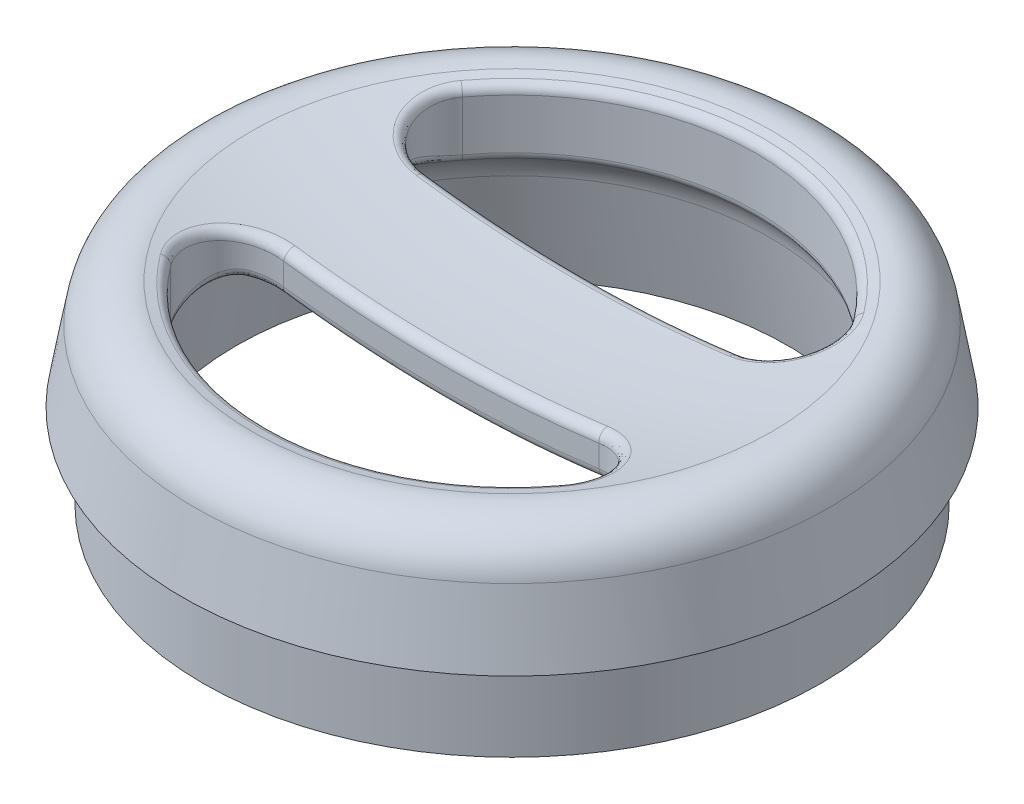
from build123d import *

# Parameters (mm, degrees)
SKETCH1_R        = 16.6751
SHAFT_DEPTH      = 4.572
VENT_HOLES_DEPTH = 26.837631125
FILLET1_R        = 0.508


with BuildPart() as part:
    # Sketch1 → Shaft (new body)
    with BuildSketch(Plane(origin=(0, 0, 0), x_dir=(1, 0, 0), z_dir=(0, 1, 0))):
        with Locations(Location((0, 0, 0), (0, 0, 270))):
            Circle(SKETCH1_R)
    extrude(amount=-SHAFT_DEPTH)

    # Sketch11 → Cap OD (revolve)
    with BuildSketch(Plane.XY, mode=Mode.PRIVATE) as cap_od_sk:
        with BuildLine():
            Line((0, 0), (17.78, 0))
            Line((17.78, 0), (17.102081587, 3.844666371))
            ThreePointArc((17.102081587, 3.844666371), (16.008019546, 5.518066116), (14.042001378, 5.881399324))
            ThreePointArc((14.042001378, 5.881399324), (7.064382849, 4.710053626), (0, 4.318))
            Line((0, 4.318), (0, 0))
        make_face()
    revolve(cap_od_sk.sketch.rotate(Axis((0, 0, 0), (0, 1, 0)), 90), axis=Axis((0, 0, 0), (0, 1, 0)))

    # Sketch12 → Inside (revolve, cut)
    with BuildSketch(Plane.XY):
        with BuildLine():
            Line((14.8844, -4.572), (13.906085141, 0.976299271))
            ThreePointArc((13.906085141, 0.976299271), (12.869307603, 2.610430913), (10.982278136, 3.039865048))
            ThreePointArc((10.982278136, 3.039865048), (5.5103546, 2.35059348), (0, 2.120300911))
            Line((0, 2.120300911), (0, -4.572))
            Line((0, -4.572), (14.8844, -4.572))
        make_face()
    revolve(axis=Axis((0, 11.538585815, 0), (0, -1, 0)), mode=Mode.SUBTRACT)

    # Sketch13 → Vent Holes (cut, through all)
    with BuildSketch(Plane(origin=(0, 0, 0), x_dir=(1, 0, 0), z_dir=(0, 1, 0))):
        with BuildLine():
            Line((-8.508962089, 3.81), (8.508962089, 3.81))
            ThreePointArc((8.508962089, 3.81), (10.779447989, 5.211363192), (10.544598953, 7.869138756))
            ThreePointArc((10.544598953, 7.869138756), (0, 13.1572), (-10.544598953, 7.869138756))
            ThreePointArc((-10.544598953, 7.869138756), (-10.779447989, 5.211363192), (-8.508962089, 3.81))
        make_face()
        with BuildLine():
            Line((-8.508962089, -3.81), (8.508962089, -3.81))
            ThreePointArc((8.508962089, -3.81), (10.779447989, -5.211363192), (10.544598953, -7.869138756))
            ThreePointArc((10.544598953, -7.869138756), (0, -13.1572), (-10.544598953, -7.869138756))
            ThreePointArc((-10.544598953, -7.869138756), (-10.779447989, -5.211363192), (-8.508962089, -3.81))
        make_face()
    extrude(amount=VENT_HOLES_DEPTH, mode=Mode.SUBTRACT)

    # Fillet1
    fillet1_edges = [part.edges().sort_by_distance(p)[0] for p in [
        (0, 2.373778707, -13.1572),
        (11.028443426, 2.793039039, -6.027798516),
        (-11.028443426, 2.793039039, -6.027798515),
        (0, 2.230296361, -3.81),
        (10.774364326, 5.44906489, -5.201282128),
        (9.34225457, 2.903908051, -3.950578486),
        (-10.774364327, 5.44906489, -5.201282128),
        (-9.34225457, 2.903908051, -3.950578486),
        (4.264036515, 4.574600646, -3.81),
        (0, 5.783374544, -13.599942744),
        (-11.028443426, 2.793039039, 6.027798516),
        (0, 2.373778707, 13.1572),
        (11.028443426, 2.793039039, 6.027798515),
        (0, 2.230296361, 3.81),
        (0, 4.431788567, 3.81),
        (0, 5.688487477, 13.157199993),
        (-10.774364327, 5.44906489, 5.201282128),
        (-9.34225457, 2.903908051, 3.950578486),
        (10.774364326, 5.44906489, 5.201282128),
        (9.34225457, 2.903908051, 3.950578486),
    ]]
    fillet(fillet1_edges, radius=FILLET1_R)


solid = part.part
